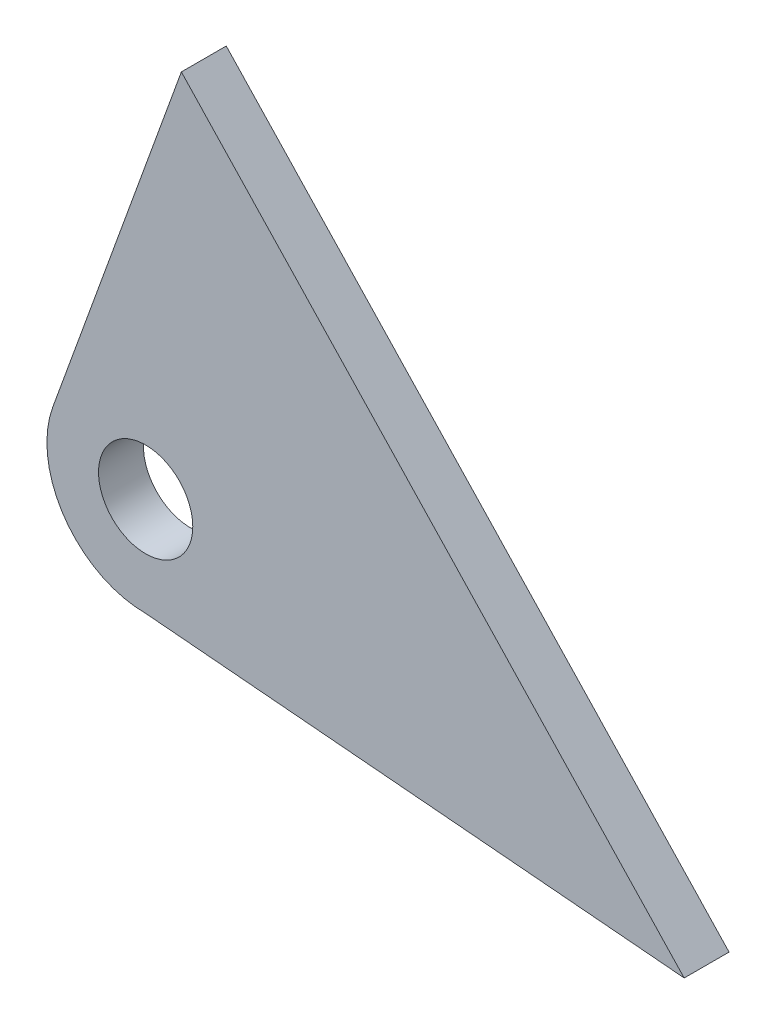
from build123d import *

# Parameters (mm, degrees)
ESQUISSE1_R      = 5.25
EXTRUSION1_DEPTH = 5


with BuildPart() as part:
    # Esquisse1 → Extrusion1 (new body)
    with BuildSketch(Plane.XY.offset(-20)):
        with BuildLine():
            Line((-25.340942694, -6.249679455), (-11.021536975, 33.233919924))
            Line((-11.021536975, 33.233919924), (45, -26.179731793))
            Line((45, -26.179731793), (-15, -21))
            ThreePointArc((-15, -21), (-24.007039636, -16.314525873), (-25.340942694, -6.249679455))
        make_face()
        with Locations((-15, -10)):
            Circle(ESQUISSE1_R, mode=Mode.SUBTRACT)
    extrude(amount=EXTRUSION1_DEPTH)


solid = part.part
